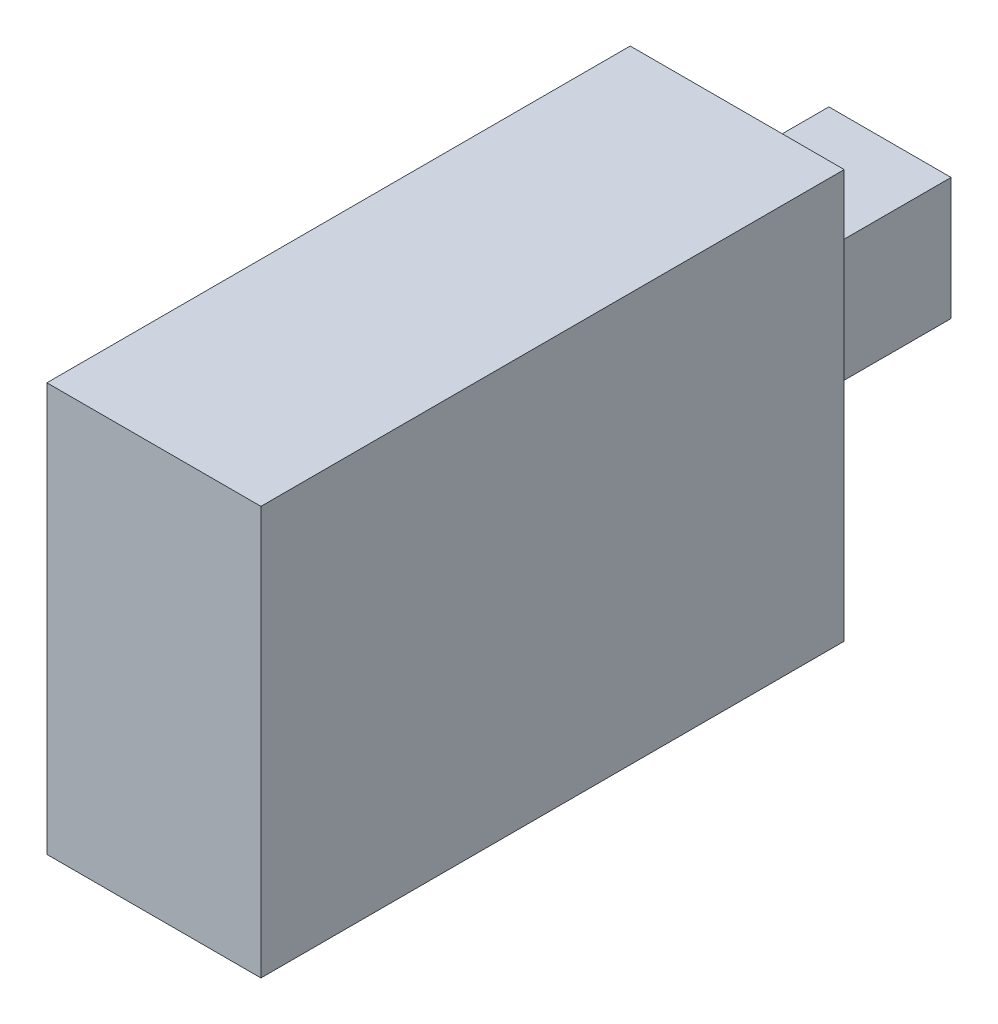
from build123d import *

# Parameters (mm, degrees)
SKETCH1_W      = 6.6548
SKETCH1_H      = 12.7
EXTRUDE1_DEPTH = 9.068
SKETCH2_W      = 3.8
SKETCH2_H      = 3.8
EXTRUDE2_DEPTH = 4.75


with BuildPart() as part:
    # Sketch1 → Extrude1 (new, symmetric)
    with BuildSketch(Plane.XY):
        Rectangle(SKETCH1_W, SKETCH1_H)
    extrude(amount=EXTRUDE1_DEPTH, both=True)

    # Sketch2 → Extrude2 (add)
    with BuildSketch(Plane(origin=(0, 0, -9.068), x_dir=(-1, 0, 0), z_dir=(0, 0, -1))):
        with Locations((0, 1.15)):
            Rectangle(SKETCH2_W, SKETCH2_H)
    extrude(amount=EXTRUDE2_DEPTH)


solid = part.part
